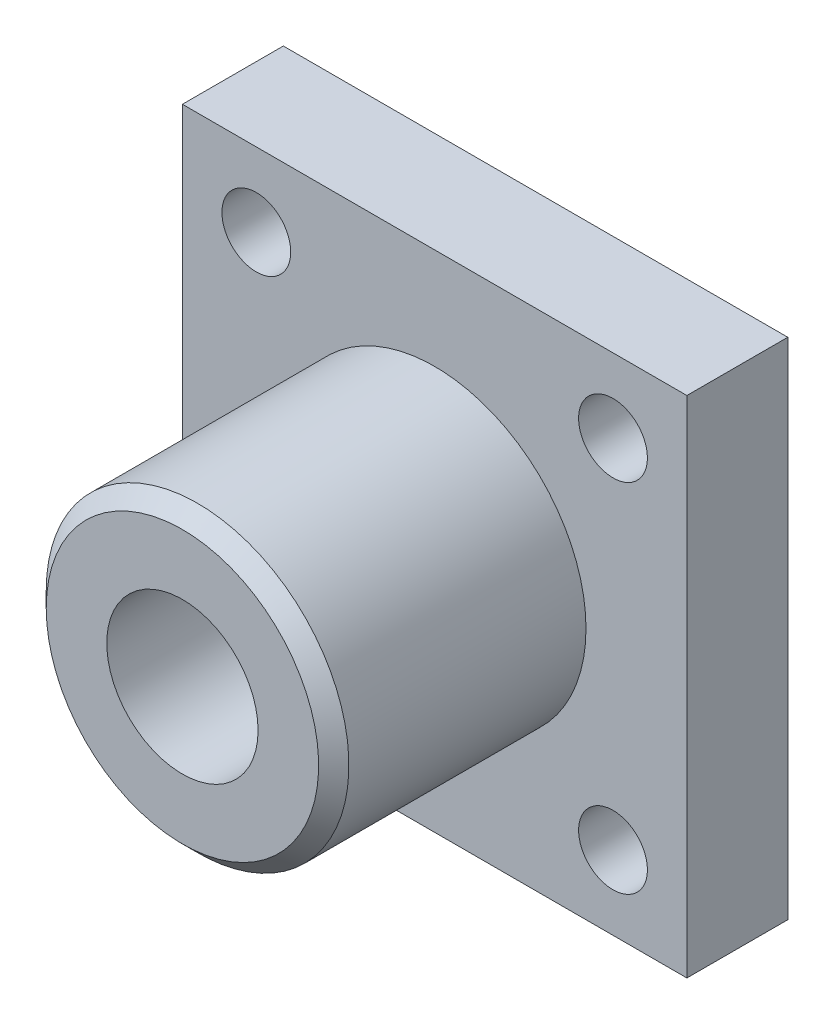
from build123d import *

# Parameters (mm, degrees)
SKETCH1_W          = 254
SKETCH1_H          = 254
EXTRUDE1_DEPTH     = 50.8
SKETCH2_R          = 17.324020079
CUT_EXTRUDE1_DEPTH = 187.6511184
SKETCH3_R          = 76.2
EXTRUDE2_DEPTH     = 127
CHAMFER1_SIZE      = 7.62
SKETCH4_R          = 38.1
CUT_EXTRUDE2_DEPTH = 253.726809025


with BuildPart() as part:
    # Sketch1 → Extrude1 (new body)
    with BuildSketch(Plane.XY):
        Rectangle(SKETCH1_W, SKETCH1_H)
    extrude(amount=EXTRUDE1_DEPTH)

    # Sketch2 → Cut-Extrude1 (cut, through all)
    with BuildSketch(Plane.XY.offset(50.8)):
        with Locations((89.802561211, 89.802561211)):
            Circle(SKETCH2_R)
        with Locations((-89.802561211, 89.802561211)):
            Circle(SKETCH2_R)
        with Locations((-89.802561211, -89.802561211)):
            Circle(SKETCH2_R)
        with Locations((89.802561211, -89.802561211)):
            Circle(SKETCH2_R)
    extrude(amount=-CUT_EXTRUDE1_DEPTH, mode=Mode.SUBTRACT)

    # Sketch3 → Extrude2 (add)
    with BuildSketch(Plane.XY.offset(50.8)):
        with Locations(Location((0, 0, 0), (0, 0, 180))):
            Circle(SKETCH3_R)
    extrude(amount=EXTRUDE2_DEPTH)

    # Chamfer1
    chamfer1_edges = [part.edges().sort_by_distance(p)[0] for p in [
        (76.2, 0, 177.8),
    ]]
    chamfer(chamfer1_edges, length=CHAMFER1_SIZE)

    # Sketch4 → Cut-Extrude2 (cut, through all)
    with BuildSketch(Plane.XY.offset(177.8)):
        Circle(SKETCH4_R)
    extrude(amount=-CUT_EXTRUDE2_DEPTH, mode=Mode.SUBTRACT)


solid = part.part
